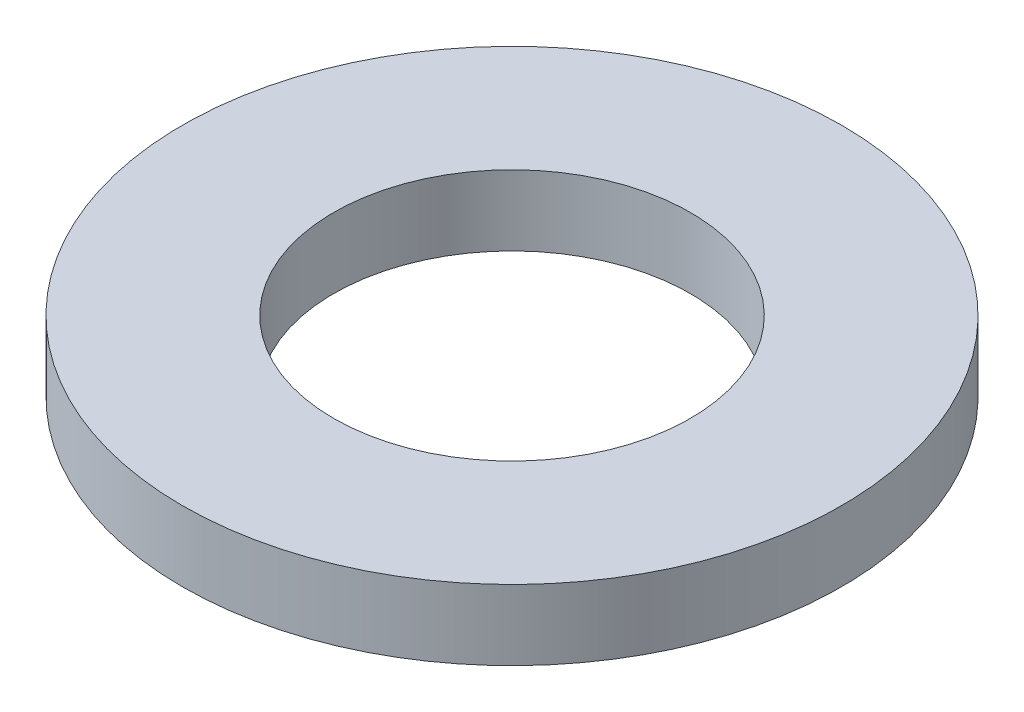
from build123d import *

# Parameters (mm, degrees)
SKETCH1_R           = 19.05
BOSS_EXTRUDE1_DEPTH = 4.064
SKETCH5_R           = 10.3124
CUT_EXTRUDE1_DEPTH  = 28.245570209


with BuildPart() as part:
    # Sketch1 → Boss-Extrude1 (new body)
    with BuildSketch(Plane(origin=(0, 0, 0), x_dir=(1, 0, 0), z_dir=(0, 1, 0))):
        with Locations(Location((0, 0, 0), (0, 0, 270))):
            Circle(SKETCH1_R)
    extrude(amount=BOSS_EXTRUDE1_DEPTH)

    # Sketch5 → Cut-Extrude1 (cut, through all)
    with BuildSketch(Plane(origin=(0, 4.064, 0), x_dir=(-1, 0, 0), z_dir=(0, 1, 0))):
        with Locations(Location((0, 0, 0), (0, 0, 90))):
            Circle(SKETCH5_R)
    extrude(amount=-CUT_EXTRUDE1_DEPTH, mode=Mode.SUBTRACT)


solid = part.part
